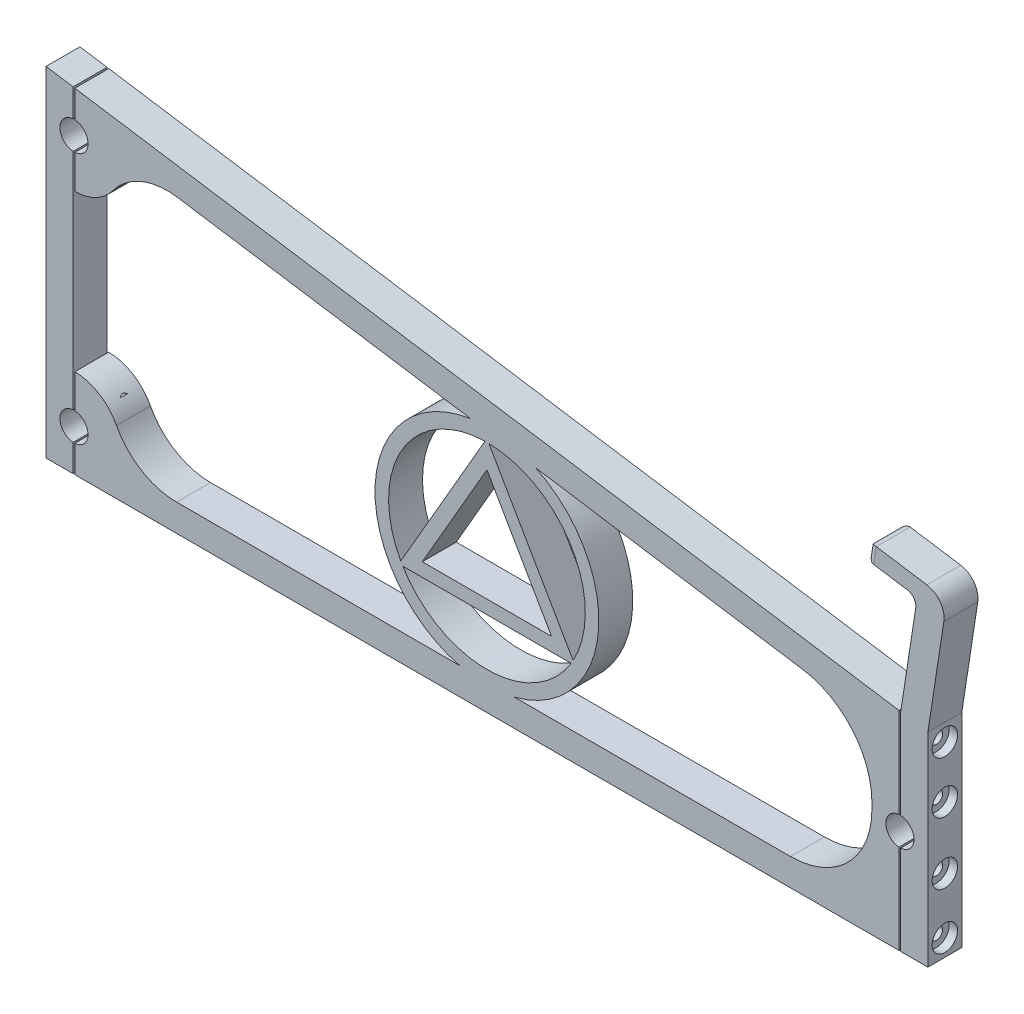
from build123d import *

# Parameters (mm, degrees)
BOSS_EXTRUDE1_DEPTH   = 5
BOSS_EXTRUDE1_2_DEPTH = 5
BOSS_EXTRUDE1_3_DEPTH = 5
FILLET1_R             = 20
FILLET2_R             = 24
FILLET3_R             = 3
FILLET4_R             = 6
FILLET5_R             = 2
SKETCH2_R             = 33
BOSS_EXTRUDE2_DEPTH   = 5
SKETCH3_R             = 1.5
CUT_EXTRUDE1_DEPTH    = 18
SKETCH4_R             = 1.875
CUT_EXTRUDE2_DEPTH    = 8
SKETCH5_R             = 3.75
CUT_EXTRUDE3_DEPTH    = 2.5
SKETCH7_R             = 1.5
CUT_EXTRUDE4_DEPTH    = 21
SKETCH8_R             = 1.875
CUT_EXTRUDE5_DEPTH    = 8
SKETCH9_R             = 3.75
CUT_EXTRUDE6_DEPTH    = 2.5


with BuildPart() as part:
    # Sketch1 → Boss-Extrude1 (new, symmetric)
    with BuildSketch(Plane.XY):
        with BuildLine():
            Line((0, 0), (0, 100))
            Line((0, 100), (8, 98.769230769))
            Line((8, 98.769230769), (8, 90.590649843))
            ThreePointArc((8, 90.590649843), (4.1, 86.448186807), (8, 82.305723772))
            Line((8, 82.305723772), (8, 16.292463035))
            ThreePointArc((8, 16.292463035), (4.1, 12.15), (8, 8.007536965))
            Line((8, 8.007536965), (8, 0))
            Line((8, 0), (0, 0))
        make_face()
    extrude(amount=BOSS_EXTRUDE1_DEPTH, both=True)


with BuildPart() as body_2:
    # Sketch1 → Boss-Extrude1 2 (new, symmetric)
    with BuildSketch(Plane.XY):
        with BuildLine():
            Line((260, 60), (260, 0))
            Line((260, 0), (252, 0))
            Line((252, 0), (252, 26.425861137))
            ThreePointArc((252, 26.425861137), (255.9, 30.568324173), (252, 34.710787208))
            Line((252, 34.710787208), (252, 61.230769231))
            Line((252, 61.230769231), (256.865829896, 92.858663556))
            Line((256.865829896, 92.858663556), (242.040254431, 95.139521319))
            Line((242.040254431, 95.139521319), (242.800540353, 100.081379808))
            Line((242.800540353, 100.081379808), (265.626115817, 96.569752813))
            Line((265.626115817, 96.569752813), (264.561715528, 89.65115093))
            Line((264.561715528, 89.65115093), (260, 60))
        make_face()
    extrude(amount=BOSS_EXTRUDE1_2_DEPTH, both=True)

    # Fillet3
    fillet3_edges = [body_2.edges().sort_by_distance(p)[0] for p in [
        (256.865829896, 92.858663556, 0),
    ]]
    fillet(fillet3_edges, radius=FILLET3_R)

    # Fillet4
    fillet4_edges = [body_2.edges().sort_by_distance(p)[0] for p in [
        (265.626115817, 96.569752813, 0),
    ]]
    fillet(fillet4_edges, radius=FILLET4_R)

    # Fillet5
    fillet5_edges = [body_2.edges().sort_by_distance(p)[0] for p in [
        (242.420397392, 97.610450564, -5),
        (242.420397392, 97.610450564, 5),
        (242.040254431, 95.139521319, 0),
        (242.800540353, 100.081379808, 0),
    ]]
    fillet(fillet5_edges, radius=FILLET5_R)


with BuildPart() as body_3:
    # Sketch1 → Boss-Extrude1 3 (new, symmetric)
    with BuildSketch(Plane.XY):
        with BuildLine():
            Line((243.5, 8), (21.777749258, 8))
            ThreePointArc((21.777749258, 8), (19.702461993, 20.460452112), (8.5, 26.297791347))
            Line((8.5, 26.297791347), (8.5, 16.292463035))
            ThreePointArc((8.5, 16.292463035), (12.4, 12.15), (8.5, 8.007536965))
            Line((8.5, 8.007536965), (8.5, 0))
            Line((8.5, 0), (251.5, 0))
            Line((251.5, 0), (251.5, 26.425861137))
            ThreePointArc((251.5, 26.425861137), (247.6, 30.568324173), (251.5, 34.710787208))
            Line((251.5, 34.710787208), (251.5, 61.307692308))
            Line((251.5, 61.307692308), (8.5, 98.692307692))
            Line((8.5, 98.692307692), (8.5, 90.590649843))
            ThreePointArc((8.5, 90.590649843), (12.4, 86.448186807), (8.5, 82.305723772))
            Line((8.5, 82.305723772), (8.5, 72.30039546))
            ThreePointArc((8.5, 72.30039546), (19.031975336, 77.284589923), (22.253025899, 88.482336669))
            Line((22.253025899, 88.482336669), (243.5, 54.444340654))
            Line((243.5, 54.444340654), (243.5, 8))
        make_face()
    extrude(amount=BOSS_EXTRUDE1_3_DEPTH, both=True)

    # Fillet1
    fillet1_edges = [body_3.edges().sort_by_distance(p)[0] for p in [
        (22.253025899, 88.482336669, 0),
        (21.777749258, 8, 0),
    ]]
    fillet(fillet1_edges, radius=FILLET1_R)

    # Fillet2
    fillet2_edges = [body_3.edges().sort_by_distance(p)[0] for p in [
        (243.5, 54.444340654, 0),
        (243.5, 8, 0),
    ]]
    fillet(fillet2_edges, radius=FILLET2_R)

    # Sketch2 → Boss-Extrude2 (add, symmetric)
    with BuildSketch(Plane.XY):
        with Locations((130, 40)):
            Circle(SKETCH2_R)
        Polygon((130, 62), (110.947441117, 29), (149.052558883, 29), align=None, mode=Mode.SUBTRACT)
        with BuildLine():
            Line((129.419292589, 68.99418526), (104.599945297, 26.00581474))
            ThreePointArc((104.599945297, 26.00581474), (104.88526329, 54.5), (129.419292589, 68.99418526))
        make_face(mode=Mode.SUBTRACT)
        with BuildLine():
            Line((105.180652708, 25), (154.819347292, 25))
            ThreePointArc((154.819347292, 25), (130, 11), (105.180652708, 25))
        make_face(mode=Mode.SUBTRACT)
        with BuildLine():
            Line((155.400054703, 26.00581474), (130.580707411, 68.99418526))
            ThreePointArc((130.580707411, 68.99418526), (155.11473671, 54.5), (155.400054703, 26.00581474))
        make_face(mode=Mode.SUBTRACT)
    extrude(amount=BOSS_EXTRUDE2_DEPTH, both=True)


with BuildPart() as cut_extrude1_tool:
    # Sketch3 → Cut-Extrude1 (new body)
    with BuildSketch(Plane(origin=(0, 0, 0), x_dir=(0, 0, -1), z_dir=(1, 0, 0))):
        with Locations(Location((0, 94.090649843, 0), (0, 0, 90))):
            Circle(SKETCH3_R)
        with Locations(Location((0, 77.303059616, 0), (0, 0, 227.710282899))):
            Circle(SKETCH3_R)
        with Locations(Location((0, 21.295127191, 0), (0, 0, 132.289717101))):
            Circle(SKETCH3_R)
        with Locations(Location((0, 4.003768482, 0), (0, 0, 90))):
            Circle(SKETCH3_R)
    extrude(amount=CUT_EXTRUDE1_DEPTH)


with BuildPart() as part_1:
    add(part.part)

    # Cut-Extrude1: cut by cut_extrude1_tool
    add(cut_extrude1_tool.part, mode=Mode.SUBTRACT)

    # Sketch4 → Cut-Extrude2 (cut)
    with BuildSketch(Plane(origin=(0, 0, 0), x_dir=(0, 0, -1), z_dir=(1, 0, 0))):
        with Locations((0, 94.090649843)):
            Circle(SKETCH4_R)
        with Locations((0, 77.303059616)):
            Circle(SKETCH4_R)
        with Locations((0, 21.295127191)):
            Circle(SKETCH4_R)
        with Locations((0, 4.003768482)):
            Circle(SKETCH4_R)
    extrude(amount=CUT_EXTRUDE2_DEPTH, mode=Mode.SUBTRACT)

    # Sketch5 → Cut-Extrude3 (cut)
    with BuildSketch(Plane(origin=(0, 0, 0), x_dir=(0, 0, -1), z_dir=(1, 0, 0))):
        with Locations((0, 94.090649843)):
            Circle(SKETCH5_R)
        with Locations((0, 77.303059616)):
            Circle(SKETCH5_R)
        with Locations((0, 21.295127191)):
            Circle(SKETCH5_R)
        with Locations((0, 4.003768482)):
            Circle(SKETCH5_R)
    extrude(amount=CUT_EXTRUDE3_DEPTH, mode=Mode.SUBTRACT)


with BuildPart() as body_3_1:
    add(body_3.part)

    # Cut-Extrude1: cut by cut_extrude1_tool
    add(cut_extrude1_tool.part, mode=Mode.SUBTRACT)


with BuildPart() as cut_extrude4_tool:
    # Sketch7 → Cut-Extrude4 (new body)
    with BuildSketch(Plane(origin=(260, 0, 0), x_dir=(0, 0, -1), z_dir=(1, 0, 0))):
        with Locations((0, 55)):
            Circle(SKETCH7_R)
        with Locations((0, 39.710787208)):
            Circle(SKETCH7_R)
        with Locations((0, 21.425861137)):
            Circle(SKETCH7_R)
        with Locations((0, 5)):
            Circle(SKETCH7_R)
    extrude(amount=-CUT_EXTRUDE4_DEPTH)


with BuildPart() as body_2_1:
    add(body_2.part)

    # Cut-Extrude4: cut by cut_extrude4_tool
    add(cut_extrude4_tool.part, mode=Mode.SUBTRACT)

    # Sketch8 → Cut-Extrude5 (cut)
    with BuildSketch(Plane(origin=(260, 0, 0), x_dir=(0, 0, -1), z_dir=(1, 0, 0))):
        with Locations((0, 55)):
            Circle(SKETCH8_R)
        with Locations((0, 39.710787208)):
            Circle(SKETCH8_R)
        with Locations((0, 21.425861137)):
            Circle(SKETCH8_R)
        with Locations((0, 5)):
            Circle(SKETCH8_R)
    extrude(amount=-CUT_EXTRUDE5_DEPTH, mode=Mode.SUBTRACT)

    # Sketch9 → Cut-Extrude6 (cut)
    with BuildSketch(Plane(origin=(260, 0, 0), x_dir=(0, 0, -1), z_dir=(1, 0, 0))):
        with Locations((0, 55)):
            Circle(SKETCH9_R)
        with Locations((0, 39.710787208)):
            Circle(SKETCH9_R)
        with Locations((0, 21.425861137)):
            Circle(SKETCH9_R)
        with Locations((0, 5)):
            Circle(SKETCH9_R)
    extrude(amount=-CUT_EXTRUDE6_DEPTH, mode=Mode.SUBTRACT)


with BuildPart() as body_3_2:
    add(body_3_1.part)

    # Cut-Extrude4: cut by cut_extrude4_tool
    add(cut_extrude4_tool.part, mode=Mode.SUBTRACT)


solid = Compound([part_1.part, body_2_1.part, body_3_2.part])
